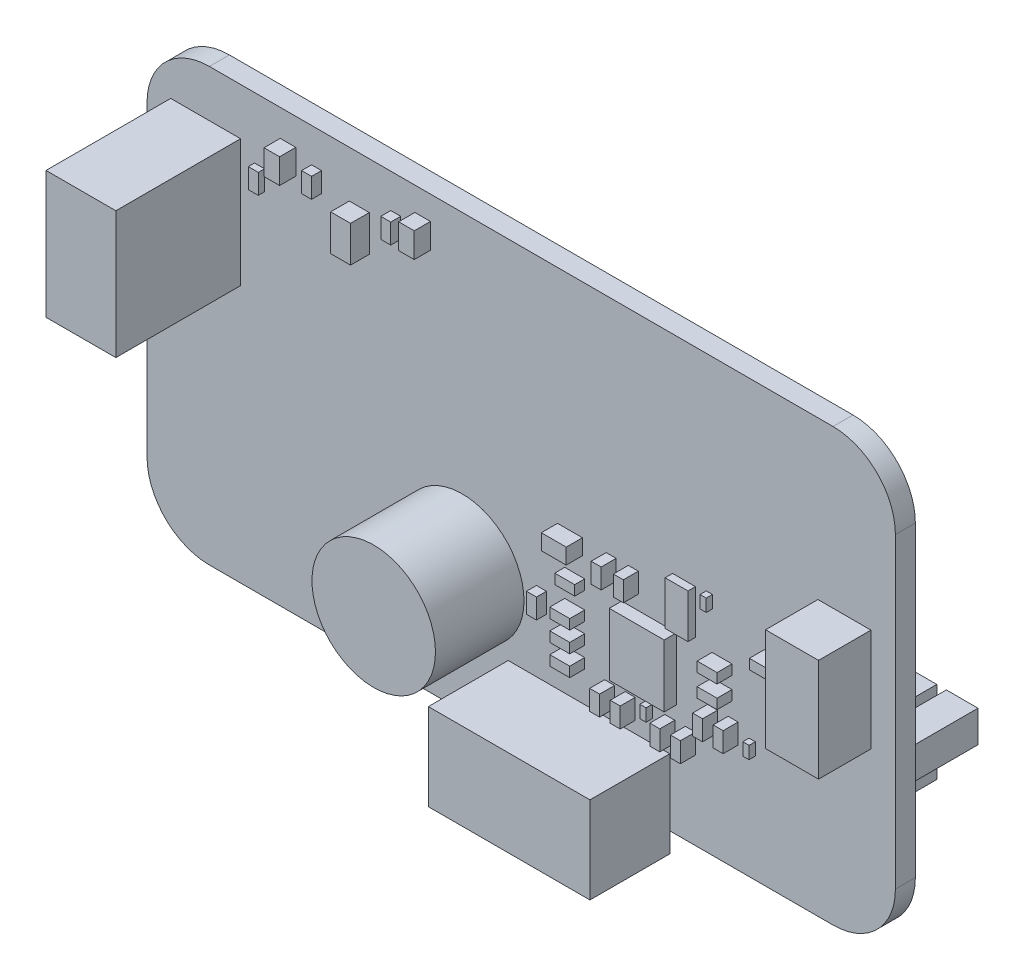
from build123d import *

# Parameters (mm, degrees)
SOURCE_PCB_OUTLINE_AND_HOLES_START = -1.6
SOURCE_PCB_OUTLINE_AND_HOLES_DEPTH = 1.6
SKETCH_2_R                         = 4.95
ACOUSTIC_CASES_0_DEPTH             = 7.1
SKETCH_3_W                         = 1.249984
SKETCH_3_H                         = 1.999996
COMPONENT_ENVELOPES_1_1_DEPTH      = 1.3
COMPONENT_ENVELOPES_1_1_2_DEPTH    = 1.3
SKETCH_3_W_2                       = 1.999996
SKETCH_3_H_2                       = 1.249984
COMPONENT_ENVELOPES_1_1_3_DEPTH    = 1.3
SKETCH_4_W                         = 0.799998
SKETCH_4_H                         = 1.599996
COMPONENT_ENVELOPES_2_1_DEPTH      = 0.8
COMPONENT_ENVELOPES_2_1_2_DEPTH    = 0.8
SKETCH_4_W_2                       = 1.599996
SKETCH_4_H_2                       = 0.799998
COMPONENT_ENVELOPES_2_1_3_DEPTH    = 0.8
COMPONENT_ENVELOPES_2_1_4_DEPTH    = 0.8
COMPONENT_ENVELOPES_3_1_START      = -2.4
SKETCH_5_W                         = 0.799998
SKETCH_5_H                         = 1.599996
COMPONENT_ENVELOPES_3_1_DEPTH      = 0.8
COMPONENT_ENVELOPES_4_1_START      = -2.9
SKETCH_6_W                         = 1.249984
SKETCH_6_H                         = 1.999996
COMPONENT_ENVELOPES_4_1_DEPTH      = 1.3
SKETCH_7_W                         = 0.500024
SKETCH_7_H                         = 0.999998
COMPONENT_ENVELOPES_5_1_DEPTH      = 0.5
COMPONENT_ENVELOPES_5_1_2_DEPTH    = 0.5
COMPONENT_ENVELOPES_5_1_3_DEPTH    = 0.5
SKETCH_7_W_2                       = 0.799998
SKETCH_7_H_2                       = 1.599996
COMPONENT_ENVELOPES_5_1_4_DEPTH    = 0.5
SKETCH_8_W                         = 5.599988
SKETCH_8_H                         = 10.19998
COMPONENT_ENVELOPES_6_1_DEPTH      = 10
SKETCH_9_W                         = 0.799998
SKETCH_9_H                         = 1.599996
COMPONENT_ENVELOPES_7_1_DEPTH      = 1.2
COMPONENT_ENVELOPES_7_1_2_DEPTH    = 1.2
SKETCH_9_W_2                       = 1.599996
SKETCH_9_H_2                       = 0.799998
COMPONENT_ENVELOPES_7_1_3_DEPTH    = 1.2
COMPONENT_ENVELOPES_7_1_4_DEPTH    = 1.2
COMPONENT_ENVELOPES_7_1_5_DEPTH    = 1.2
COMPONENT_ENVELOPES_7_1_6_DEPTH    = 1.2
COMPONENT_ENVELOPES_7_1_7_DEPTH    = 1.2
COMPONENT_ENVELOPES_7_1_8_DEPTH    = 1.2
SKETCH_10_W                        = 0.799998
SKETCH_10_H                        = 1.599996
COMPONENT_ENVELOPES_7_2_DEPTH      = 1.2
COMPONENT_ENVELOPES_7_2_2_DEPTH    = 1.2
SKETCH_10_W_2                      = 1.599996
SKETCH_10_H_2                      = 0.799998
COMPONENT_ENVELOPES_7_2_3_DEPTH    = 1.2
COMPONENT_ENVELOPES_7_2_4_DEPTH    = 1.2
COMPONENT_ENVELOPES_7_2_5_DEPTH    = 1.2
COMPONENT_ENVELOPES_7_2_6_DEPTH    = 1.2
SKETCH_11_W                        = 1.834184
SKETCH_11_H                        = 3.522268
COMPONENT_ENVELOPES_8_1_DEPTH      = 0.6
SKETCH_12_W                        = 12.954
SKETCH_12_H                        = 6.954012
COMPONENT_ENVELOPES_9_1_DEPTH      = 6.4
SKETCH_13_W                        = 1.600022
SKETCH_13_H                        = 2.90002
COMPONENT_ENVELOPES_10_1_DEPTH     = 1.5
SKETCH_14_W                        = 4.399992
SKETCH_14_H                        = 4.99999
COMPONENT_ENVELOPES_11_1_DEPTH     = 1
SKETCH_15_W                        = 4.250004
SKETCH_15_H                        = 8.249996
COMPONENT_ENVELOPES_12_1_DEPTH     = 4.2
COMPONENT_ENVELOPES_13_1_START     = -9.6
SKETCH_16_W                        = 2.54
SKETCH_16_H                        = 2.54
COMPONENT_ENVELOPES_13_1_DEPTH     = 8
COMPONENT_ENVELOPES_13_1_2_DEPTH   = 8
COMPONENT_ENVELOPES_13_1_3_DEPTH   = 8
COMPONENT_ENVELOPES_13_1_4_DEPTH   = 8
COMPONENT_ENVELOPES_13_1_5_DEPTH   = 8


with BuildPart() as part:
    # Sketch 1 → Source_PCB_outline_and_holes (new body)
    with BuildSketch(Plane.XY.offset(SOURCE_PCB_OUTLINE_AND_HOLES_START)):
        with BuildLine():
            Line((5, -34.61900112), (54.99999938, -34.61900112))
            ThreePointArc((54.99999938, -34.61900112), (58.535533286, -33.154535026), (59.99999938, -29.61900112))
            Line((59.99999938, -29.61900112), (59.99999938, -5))
            ThreePointArc((59.99999938, -5), (58.535533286, -1.464466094), (54.99999938, 0))
            Line((54.99999938, 0), (5, 0))
            ThreePointArc((5, 0), (1.464466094, -1.464466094), (0, -5))
            Line((0, -5), (0, -29.61900112))
            ThreePointArc((0, -29.61900112), (1.464466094, -33.154535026), (5, -34.61900112))
        make_face()
    extrude(amount=SOURCE_PCB_OUTLINE_AND_HOLES_DEPTH)


with BuildPart() as body_2:
    # Sketch 2 → Acoustic_cases_0 (new body)
    with BuildSketch(Plane.XY):
        with Locations((25.273, -24.491)):
            Circle(SKETCH_2_R)
    extrude(amount=ACOUSTIC_CASES_0_DEPTH)


with BuildPart() as body_3:
    # Sketch 3 → Component_envelopes_1_1 (new body)
    with BuildSketch(Plane.XY):
        with Locations((11.303, -3.155)):
            Rectangle(SKETCH_3_W, SKETCH_3_H)
    extrude(amount=COMPONENT_ENVELOPES_1_1_DEPTH)


with BuildPart() as body_4:
    # Sketch 3 → Component_envelopes_1_1 2 (new body)
    with BuildSketch(Plane.XY):
        with Locations((22.098, -2.901)):
            Rectangle(SKETCH_3_W, SKETCH_3_H)
    extrude(amount=COMPONENT_ENVELOPES_1_1_2_DEPTH)


with BuildPart() as body_5:
    # Sketch 3 → Component_envelopes_1_1 3 (new body)
    with BuildSketch(Plane.XY):
        with Locations((33.909, -18.395)):
            Rectangle(SKETCH_3_W_2, SKETCH_3_H_2)
    extrude(amount=COMPONENT_ENVELOPES_1_1_3_DEPTH)


with BuildPart() as body_6:
    # Sketch 4 → Component_envelopes_2_1 (new body)
    with BuildSketch(Plane.XY):
        with Locations((13.589, -3.536)):
            Rectangle(SKETCH_4_W, SKETCH_4_H)
    extrude(amount=COMPONENT_ENVELOPES_2_1_DEPTH)


with BuildPart() as body_7:
    # Sketch 4 → Component_envelopes_2_1 2 (new body)
    with BuildSketch(Plane.XY):
        with Locations((19.939, -3.536)):
            Rectangle(SKETCH_4_W, SKETCH_4_H)
    extrude(amount=COMPONENT_ENVELOPES_2_1_2_DEPTH)


with BuildPart() as body_8:
    # Sketch 4 → Component_envelopes_2_1 3 (new body)
    with BuildSketch(Plane.XY):
        with Locations((34.29, -20.935)):
            Rectangle(SKETCH_4_W_2, SKETCH_4_H_2)
    extrude(amount=COMPONENT_ENVELOPES_2_1_3_DEPTH)


with BuildPart() as body_9:
    # Sketch 4 → Component_envelopes_2_1 4 (new body)
    with BuildSketch(Plane.XY):
        with Locations((31.623, -23.729)):
            Rectangle(SKETCH_4_W, SKETCH_4_H)
    extrude(amount=COMPONENT_ENVELOPES_2_1_4_DEPTH)


with BuildPart() as body_10:
    # Sketch 5 → Component_envelopes_3_1 (new body)
    with BuildSketch(Plane.XY.offset(COMPONENT_ENVELOPES_3_1_START)):
        with Locations((40.386, -22.332)):
            Rectangle(SKETCH_5_W, SKETCH_5_H)
    extrude(amount=COMPONENT_ENVELOPES_3_1_DEPTH)


with BuildPart() as body_11:
    # Sketch 6 → Component_envelopes_4_1 (new body)
    with BuildSketch(Plane.XY.offset(COMPONENT_ENVELOPES_4_1_START)):
        with Locations((42.545, -22.078)):
            Rectangle(SKETCH_6_W, SKETCH_6_H)
    extrude(amount=COMPONENT_ENVELOPES_4_1_DEPTH)


with BuildPart() as body_12:
    # Sketch 7 → Component_envelopes_5_1 (new body)
    with BuildSketch(Plane.XY):
        with Locations((40.259, -27.031)):
            Rectangle(SKETCH_7_W, SKETCH_7_H)
    extrude(amount=COMPONENT_ENVELOPES_5_1_DEPTH)


with BuildPart() as body_13:
    # Sketch 7 → Component_envelopes_5_1 2 (new body)
    with BuildSketch(Plane.XY):
        with Locations((48.514, -25.507)):
            Rectangle(SKETCH_7_W, SKETCH_7_H)
    extrude(amount=COMPONENT_ENVELOPES_5_1_2_DEPTH)


with BuildPart() as body_14:
    # Sketch 7 → Component_envelopes_5_1 3 (new body)
    with BuildSketch(Plane.XY):
        with Locations((45.085, -16.998)):
            Rectangle(SKETCH_7_W, SKETCH_7_H)
    extrude(amount=COMPONENT_ENVELOPES_5_1_3_DEPTH)


with BuildPart() as body_15:
    # Sketch 7 → Component_envelopes_5_1 4 (new body)
    with BuildSketch(Plane.XY):
        with Locations((9.016873, -5.695)):
            Rectangle(SKETCH_7_W_2, SKETCH_7_H_2)
    extrude(amount=COMPONENT_ENVELOPES_5_1_4_DEPTH)


with BuildPart() as body_16:
    # Sketch 8 → Component_envelopes_6_1 (new body)
    with BuildSketch(Plane.XY):
        with Locations((4.699, -8.87)):
            Rectangle(SKETCH_8_W, SKETCH_8_H)
    extrude(amount=COMPONENT_ENVELOPES_6_1_DEPTH)


with BuildPart() as body_17:
    # Sketch 9 → Component_envelopes_7_1 (new body)
    with BuildSketch(Plane.XY):
        with Locations((37.211, -18.649)):
            Rectangle(SKETCH_9_W, SKETCH_9_H)
    extrude(amount=COMPONENT_ENVELOPES_7_1_DEPTH)


with BuildPart() as body_18:
    # Sketch 9 → Component_envelopes_7_1 2 (new body)
    with BuildSketch(Plane.XY):
        with Locations((38.989, -18.649)):
            Rectangle(SKETCH_9_W, SKETCH_9_H)
    extrude(amount=COMPONENT_ENVELOPES_7_1_2_DEPTH)


with BuildPart() as body_19:
    # Sketch 9 → Component_envelopes_7_1 3 (new body)
    with BuildSketch(Plane.XY):
        with Locations((34.29, -24.745)):
            Rectangle(SKETCH_9_W_2, SKETCH_9_H_2)
    extrude(amount=COMPONENT_ENVELOPES_7_1_3_DEPTH)


with BuildPart() as body_20:
    # Sketch 9 → Component_envelopes_7_1 4 (new body)
    with BuildSketch(Plane.XY):
        with Locations((34.29, -26.396)):
            Rectangle(SKETCH_9_W_2, SKETCH_9_H_2)
    extrude(amount=COMPONENT_ENVELOPES_7_1_4_DEPTH)


with BuildPart() as body_21:
    # Sketch 9 → Component_envelopes_7_1 5 (new body)
    with BuildSketch(Plane.XY):
        with Locations((38.735, -27.539)):
            Rectangle(SKETCH_9_W, SKETCH_9_H)
    extrude(amount=COMPONENT_ENVELOPES_7_1_5_DEPTH)


with BuildPart() as body_22:
    # Sketch 9 → Component_envelopes_7_1 6 (new body)
    with BuildSketch(Plane.XY):
        with Locations((37.084, -27.539)):
            Rectangle(SKETCH_9_W, SKETCH_9_H)
    extrude(amount=COMPONENT_ENVELOPES_7_1_6_DEPTH)


with BuildPart() as body_23:
    # Sketch 9 → Component_envelopes_7_1 7 (new body)
    with BuildSketch(Plane.XY):
        with Locations((43.561, -27.539)):
            Rectangle(SKETCH_9_W, SKETCH_9_H)
    extrude(amount=COMPONENT_ENVELOPES_7_1_7_DEPTH)


with BuildPart() as body_24:
    # Sketch 9 → Component_envelopes_7_1 8 (new body)
    with BuildSketch(Plane.XY):
        with Locations((41.91, -27.539)):
            Rectangle(SKETCH_9_W, SKETCH_9_H)
    extrude(amount=COMPONENT_ENVELOPES_7_1_8_DEPTH)


with BuildPart() as body_25:
    # Sketch 10 → Component_envelopes_7_2 (new body)
    with BuildSketch(Plane.XY):
        with Locations((46.99, -25.126)):
            Rectangle(SKETCH_10_W, SKETCH_10_H)
    extrude(amount=COMPONENT_ENVELOPES_7_2_DEPTH)


with BuildPart() as body_26:
    # Sketch 10 → Component_envelopes_7_2 2 (new body)
    with BuildSketch(Plane.XY):
        with Locations((45.339, -25.126)):
            Rectangle(SKETCH_10_W, SKETCH_10_H)
    extrude(amount=COMPONENT_ENVELOPES_7_2_2_DEPTH)


with BuildPart() as body_27:
    # Sketch 10 → Component_envelopes_7_2 3 (new body)
    with BuildSketch(Plane.XY):
        with Locations((46.101, -20.935)):
            Rectangle(SKETCH_10_W_2, SKETCH_10_H_2)
    extrude(amount=COMPONENT_ENVELOPES_7_2_3_DEPTH)


with BuildPart() as body_28:
    # Sketch 10 → Component_envelopes_7_2 4 (new body)
    with BuildSketch(Plane.XY):
        with Locations((50.292, -18.649)):
            Rectangle(SKETCH_10_W_2, SKETCH_10_H_2)
    extrude(amount=COMPONENT_ENVELOPES_7_2_4_DEPTH)


with BuildPart() as body_29:
    # Sketch 10 → Component_envelopes_7_2 5 (new body)
    with BuildSketch(Plane.XY):
        with Locations((34.29, -23.094)):
            Rectangle(SKETCH_10_W_2, SKETCH_10_H_2)
    extrude(amount=COMPONENT_ENVELOPES_7_2_5_DEPTH)


with BuildPart() as body_30:
    # Sketch 10 → Component_envelopes_7_2 6 (new body)
    with BuildSketch(Plane.XY):
        with Locations((46.101, -22.713)):
            Rectangle(SKETCH_10_W_2, SKETCH_10_H_2)
    extrude(amount=COMPONENT_ENVELOPES_7_2_6_DEPTH)


with BuildPart() as body_31:
    # Sketch 11 → Component_envelopes_8_1 (new body)
    with BuildSketch(Plane.XY):
        with Locations((43.053, -18.395)):
            Rectangle(SKETCH_11_W, SKETCH_11_H)
    extrude(amount=COMPONENT_ENVELOPES_8_1_DEPTH)


with BuildPart() as body_32:
    # Sketch 12 → Component_envelopes_9_1 (new body)
    with BuildSketch(Plane.XY):
        with Locations((35.433, -32.746)):
            Rectangle(SKETCH_12_W, SKETCH_12_H)
    extrude(amount=COMPONENT_ENVELOPES_9_1_DEPTH)


with BuildPart() as body_33:
    # Sketch 13 → Component_envelopes_10_1 (new body)
    with BuildSketch(Plane.XY):
        with Locations((17.018038, -5.187)):
            Rectangle(SKETCH_13_W, SKETCH_13_H)
    extrude(amount=COMPONENT_ENVELOPES_10_1_DEPTH)


with BuildPart() as body_34:
    # Sketch 14 → Component_envelopes_11_1 (new body)
    with BuildSketch(Plane.XY):
        with Locations((40.259, -23.094)):
            Rectangle(SKETCH_14_W, SKETCH_14_H)
    extrude(amount=COMPONENT_ENVELOPES_11_1_DEPTH)


with BuildPart() as body_35:
    # Sketch 15 → Component_envelopes_12_1 (new body)
    with BuildSketch(Plane.XY):
        with Locations((55.913998, -16.743987)):
            Rectangle(SKETCH_15_W, SKETCH_15_H)
    extrude(amount=COMPONENT_ENVELOPES_12_1_DEPTH)


with BuildPart() as body_36:
    # Sketch 16 → Component_envelopes_13_1 (new body)
    with BuildSketch(Plane.XY.offset(COMPONENT_ENVELOPES_13_1_START)):
        with Locations((55.753, -24.618)):
            Rectangle(SKETCH_16_W, SKETCH_16_H)
    extrude(amount=COMPONENT_ENVELOPES_13_1_DEPTH)


with BuildPart() as body_37:
    # Sketch 16 → Component_envelopes_13_1 2 (new body)
    with BuildSketch(Plane.XY.offset(COMPONENT_ENVELOPES_13_1_START)):
        with Locations((40.894, -14.204)):
            Rectangle(SKETCH_16_W, SKETCH_16_H)
    extrude(amount=COMPONENT_ENVELOPES_13_1_2_DEPTH)


with BuildPart() as body_38:
    # Sketch 16 → Component_envelopes_13_1 3 (new body)
    with BuildSketch(Plane.XY.offset(COMPONENT_ENVELOPES_13_1_START)):
        with Locations((52.451, -24.618)):
            Rectangle(SKETCH_16_W, SKETCH_16_H)
    extrude(amount=COMPONENT_ENVELOPES_13_1_3_DEPTH)


with BuildPart() as body_39:
    # Sketch 16 → Component_envelopes_13_1 4 (new body)
    with BuildSketch(Plane.XY.offset(COMPONENT_ENVELOPES_13_1_START)):
        with Locations((49.53, -14.204)):
            Rectangle(SKETCH_16_W, SKETCH_16_H)
    extrude(amount=COMPONENT_ENVELOPES_13_1_4_DEPTH)


with BuildPart() as body_40:
    # Sketch 16 → Component_envelopes_13_1 5 (new body)
    with BuildSketch(Plane.XY.offset(COMPONENT_ENVELOPES_13_1_START)):
        with Locations((52.451, -28.682)):
            Rectangle(SKETCH_16_W, SKETCH_16_H)
    extrude(amount=COMPONENT_ENVELOPES_13_1_5_DEPTH)


solid = Compound([part.part, body_2.part, body_3.part, body_4.part, body_5.part, body_6.part, body_7.part, body_8.part, body_9.part, body_10.part, body_11.part, body_12.part, body_13.part, body_14.part, body_15.part, body_16.part, body_17.part, body_18.part, body_19.part, body_20.part, body_21.part, body_22.part, body_23.part, body_24.part, body_25.part, body_26.part, body_27.part, body_28.part, body_29.part, body_30.part, body_31.part, body_32.part, body_33.part, body_34.part, body_35.part, body_36.part, body_37.part, body_38.part, body_39.part, body_40.part])
